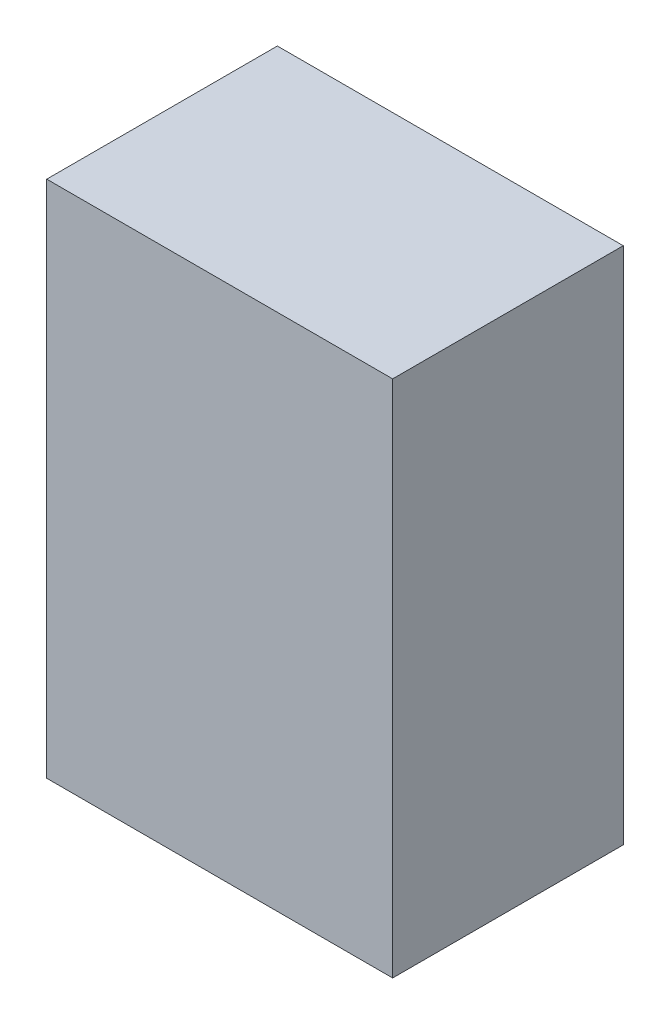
ISO-10303-21;
HEADER;
FILE_DESCRIPTION(('STEP AP214'),'2;1');
FILE_NAME('part.step','',(''),(''),'','','');
FILE_SCHEMA(('AUTOMOTIVE_DESIGN { 1 0 10303 214 1 1 1 1 }'));
ENDSEC;
DATA;
#1=APPLICATION_CONTEXT('core data for automotive mechanical design processes');
#2=APPLICATION_PROTOCOL_DEFINITION('international standard','automotive_design',2000,#1);
#3=PRODUCT_CONTEXT('',#1,'mechanical');
#4=PRODUCT('Part','Part','',(#3));
#5=PRODUCT_RELATED_PRODUCT_CATEGORY('part','',(#4));
#6=PRODUCT_DEFINITION_FORMATION('','',#4);
#7=PRODUCT_DEFINITION_CONTEXT('part definition',#1,'design');
#8=PRODUCT_DEFINITION('design','',#6,#7);
#9=PRODUCT_DEFINITION_SHAPE('','',#8);
#10=(LENGTH_UNIT() NAMED_UNIT(*) SI_UNIT(.MILLI.,.METRE.));
#11=(NAMED_UNIT(*) PLANE_ANGLE_UNIT() SI_UNIT($,.RADIAN.));
#12=(NAMED_UNIT(*) SI_UNIT($,.STERADIAN.) SOLID_ANGLE_UNIT());
#13=UNCERTAINTY_MEASURE_WITH_UNIT(LENGTH_MEASURE(1.E-05),#10,'distance_accuracy_value','');
#14=(GEOMETRIC_REPRESENTATION_CONTEXT(3) GLOBAL_UNCERTAINTY_ASSIGNED_CONTEXT((#13)) GLOBAL_UNIT_ASSIGNED_CONTEXT((#10,
#11,#12)) REPRESENTATION_CONTEXT('',''));
#15=CARTESIAN_POINT('',(0.,0.,0.));
#16=DIRECTION('',(0.,0.,1.));
#17=DIRECTION('',(1.,0.,0.));
#18=AXIS2_PLACEMENT_3D('',#15,#16,#17);
#19=CARTESIAN_POINT('',(38.1,-57.15,50.8));
#20=DIRECTION('',(-1.,0.,0.));
#21=DIRECTION('',(0.,0.,1.));
#22=AXIS2_PLACEMENT_3D('',#19,#20,#21);
#23=PLANE('',#22);
#24=DIRECTION('',(0.,1.,0.));
#25=VECTOR('',#24,1.);
#26=CARTESIAN_POINT('',(38.1,-57.15,0.));
#27=LINE('',#26,#25);
#28=CARTESIAN_POINT('',(38.1,-57.15,0.));
#29=VERTEX_POINT('',#28);
#30=CARTESIAN_POINT('',(38.1,57.15,0.));
#31=VERTEX_POINT('',#30);
#32=EDGE_CURVE('E100',#29,#31,#27,.T.);
#33=ORIENTED_EDGE('',*,*,#32,.T.);
#34=DIRECTION('',(0.,0.,-1.));
#35=VECTOR('',#34,1.);
#36=CARTESIAN_POINT('',(38.1,57.15,50.8));
#37=LINE('',#36,#35);
#38=CARTESIAN_POINT('',(38.1,57.15,50.8));
#39=VERTEX_POINT('',#38);
#40=EDGE_CURVE('E11',#39,#31,#37,.T.);
#41=ORIENTED_EDGE('',*,*,#40,.F.);
#42=DIRECTION('',(0.,1.,0.));
#43=VECTOR('',#42,1.);
#44=CARTESIAN_POINT('',(38.1,-57.15,50.8));
#45=LINE('',#44,#43);
#46=CARTESIAN_POINT('',(38.1,-57.15,50.8));
#47=VERTEX_POINT('',#46);
#48=EDGE_CURVE('E88',#47,#39,#45,.T.);
#49=ORIENTED_EDGE('',*,*,#48,.F.);
#50=DIRECTION('',(0.,0.,-1.));
#51=VECTOR('',#50,1.);
#52=CARTESIAN_POINT('',(38.1,-57.15,50.8));
#53=LINE('',#52,#51);
#54=EDGE_CURVE('E96',#47,#29,#53,.T.);
#55=ORIENTED_EDGE('',*,*,#54,.T.);
#56=EDGE_LOOP('',(#33,#41,#49,#55));
#57=FACE_BOUND('',#56,.T.);
#58=ADVANCED_FACE('F37',(#57),#23,.F.);
#59=CARTESIAN_POINT('',(-38.1,57.15,50.8));
#60=DIRECTION('',(0.,-1.,0.));
#61=DIRECTION('',(0.,0.,-1.));
#62=AXIS2_PLACEMENT_3D('',#59,#60,#61);
#63=PLANE('',#62);
#64=DIRECTION('',(-1.,0.,0.));
#65=VECTOR('',#64,1.);
#66=CARTESIAN_POINT('',(-38.1,57.15,0.));
#67=LINE('',#66,#65);
#68=CARTESIAN_POINT('',(-38.1,57.15,0.));
#69=VERTEX_POINT('',#68);
#70=EDGE_CURVE('E92',#31,#69,#67,.T.);
#71=ORIENTED_EDGE('',*,*,#70,.T.);
#72=DIRECTION('',(0.,0.,-1.));
#73=VECTOR('',#72,1.);
#74=CARTESIAN_POINT('',(-38.1,57.15,50.8));
#75=LINE('',#74,#73);
#76=CARTESIAN_POINT('',(-38.1,57.15,50.8));
#77=VERTEX_POINT('',#76);
#78=EDGE_CURVE('E45',#77,#69,#75,.T.);
#79=ORIENTED_EDGE('',*,*,#78,.F.);
#80=DIRECTION('',(-1.,0.,0.));
#81=VECTOR('',#80,1.);
#82=CARTESIAN_POINT('',(-38.1,57.15,50.8));
#83=LINE('',#82,#81);
#84=EDGE_CURVE('E83',#39,#77,#83,.T.);
#85=ORIENTED_EDGE('',*,*,#84,.F.);
#86=ORIENTED_EDGE('',*,*,#40,.T.);
#87=EDGE_LOOP('',(#71,#79,#85,#86));
#88=FACE_BOUND('',#87,.T.);
#89=ADVANCED_FACE('F91',(#88),#63,.F.);
#90=CARTESIAN_POINT('',(-38.1,-57.15,50.8));
#91=DIRECTION('',(1.,0.,0.));
#92=DIRECTION('',(0.,0.,-1.));
#93=AXIS2_PLACEMENT_3D('',#90,#91,#92);
#94=PLANE('',#93);
#95=DIRECTION('',(0.,-1.,0.));
#96=VECTOR('',#95,1.);
#97=CARTESIAN_POINT('',(-38.1,-57.15,0.));
#98=LINE('',#97,#96);
#99=CARTESIAN_POINT('',(-38.1,-57.15,0.));
#100=VERTEX_POINT('',#99);
#101=EDGE_CURVE('E70',#69,#100,#98,.T.);
#102=ORIENTED_EDGE('',*,*,#101,.T.);
#103=DIRECTION('',(0.,0.,-1.));
#104=VECTOR('',#103,1.);
#105=CARTESIAN_POINT('',(-38.1,-57.15,50.8));
#106=LINE('',#105,#104);
#107=CARTESIAN_POINT('',(-38.1,-57.15,50.8));
#108=VERTEX_POINT('',#107);
#109=EDGE_CURVE('E93',#108,#100,#106,.T.);
#110=ORIENTED_EDGE('',*,*,#109,.F.);
#111=DIRECTION('',(0.,-1.,0.));
#112=VECTOR('',#111,1.);
#113=CARTESIAN_POINT('',(-38.1,-57.15,50.8));
#114=LINE('',#113,#112);
#115=EDGE_CURVE('E86',#77,#108,#114,.T.);
#116=ORIENTED_EDGE('',*,*,#115,.F.);
#117=ORIENTED_EDGE('',*,*,#78,.T.);
#118=EDGE_LOOP('',(#102,#110,#116,#117));
#119=FACE_BOUND('',#118,.T.);
#120=ADVANCED_FACE('F94',(#119),#94,.F.);
#121=CARTESIAN_POINT('',(-38.1,-57.15,50.8));
#122=DIRECTION('',(0.,1.,0.));
#123=DIRECTION('',(0.,0.,1.));
#124=AXIS2_PLACEMENT_3D('',#121,#122,#123);
#125=PLANE('',#124);
#126=DIRECTION('',(1.,0.,0.));
#127=VECTOR('',#126,1.);
#128=CARTESIAN_POINT('',(-38.1,-57.15,0.));
#129=LINE('',#128,#127);
#130=EDGE_CURVE('E76',#100,#29,#129,.T.);
#131=ORIENTED_EDGE('',*,*,#130,.T.);
#132=ORIENTED_EDGE('',*,*,#54,.F.);
#133=DIRECTION('',(1.,0.,0.));
#134=VECTOR('',#133,1.);
#135=CARTESIAN_POINT('',(-38.1,-57.15,50.8));
#136=LINE('',#135,#134);
#137=EDGE_CURVE('E53',#108,#47,#136,.T.);
#138=ORIENTED_EDGE('',*,*,#137,.F.);
#139=ORIENTED_EDGE('',*,*,#109,.T.);
#140=EDGE_LOOP('',(#131,#132,#138,#139));
#141=FACE_BOUND('',#140,.T.);
#142=ADVANCED_FACE('F107',(#141),#125,.F.);
#143=CARTESIAN_POINT('',(0.,0.,50.8));
#144=DIRECTION('',(0.,0.,-1.));
#145=DIRECTION('',(-1.,0.,0.));
#146=AXIS2_PLACEMENT_3D('',#143,#144,#145);
#147=PLANE('',#146);
#148=ORIENTED_EDGE('',*,*,#48,.T.);
#149=ORIENTED_EDGE('',*,*,#84,.T.);
#150=ORIENTED_EDGE('',*,*,#115,.T.);
#151=ORIENTED_EDGE('',*,*,#137,.T.);
#152=EDGE_LOOP('',(#148,#149,#150,#151));
#153=FACE_BOUND('',#152,.T.);
#154=ADVANCED_FACE('F84',(#153),#147,.F.);
#155=CARTESIAN_POINT('',(0.,0.,0.));
#156=DIRECTION('',(0.,0.,-1.));
#157=DIRECTION('',(-1.,0.,0.));
#158=AXIS2_PLACEMENT_3D('',#155,#156,#157);
#159=PLANE('',#158);
#160=ORIENTED_EDGE('',*,*,#32,.F.);
#161=ORIENTED_EDGE('',*,*,#130,.F.);
#162=ORIENTED_EDGE('',*,*,#101,.F.);
#163=ORIENTED_EDGE('',*,*,#70,.F.);
#164=EDGE_LOOP('',(#160,#161,#162,#163));
#165=FACE_BOUND('',#164,.T.);
#166=ADVANCED_FACE('F110',(#165),#159,.T.);
#167=CLOSED_SHELL('',(#58,#89,#120,#142,#154,#166));
#168=MANIFOLD_SOLID_BREP('B2',#167);
#169=ADVANCED_BREP_SHAPE_REPRESENTATION('',(#18,#168),#14);
#170=SHAPE_DEFINITION_REPRESENTATION(#9,#169);
ENDSEC;
END-ISO-10303-21;
